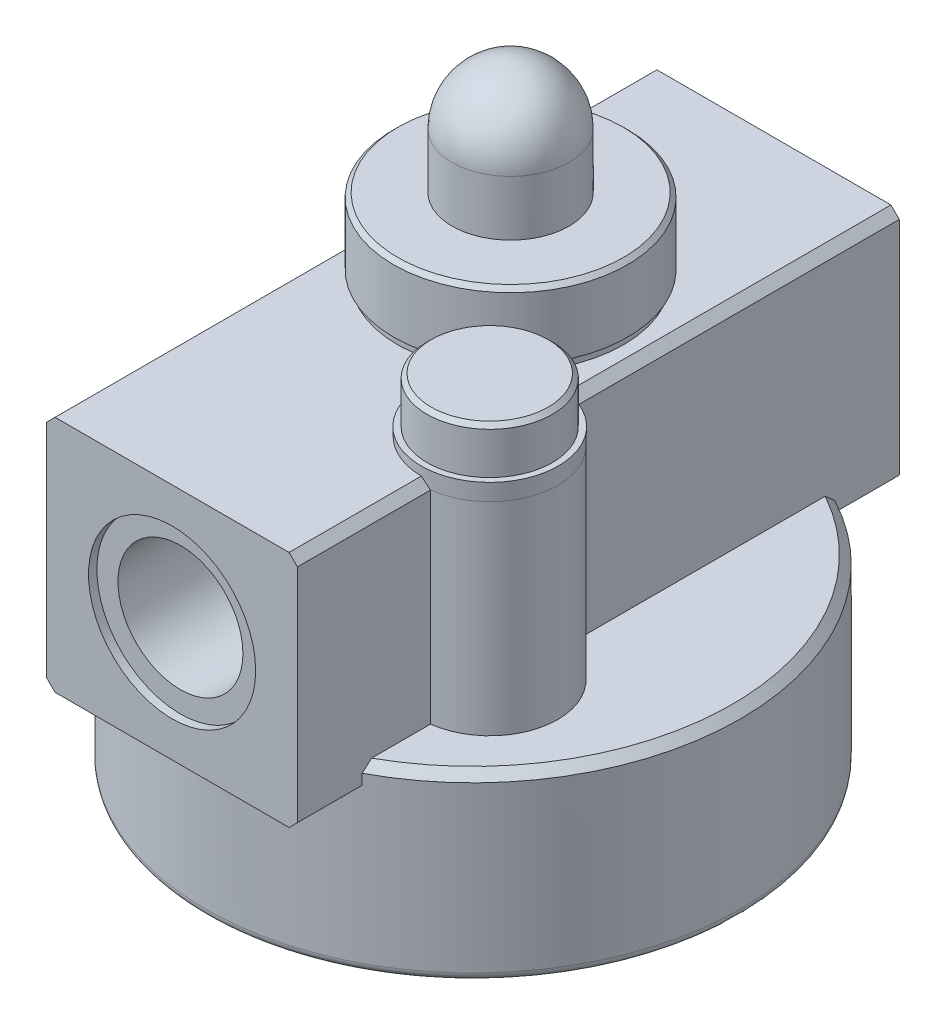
from build123d import *

# Parameters (mm, degrees)
EXTRUDE_1_DEPTH      = 36
EXTRUDE_1_DEPTH_BACK = 36


with BuildPart() as part:
    # Sketch 1 → Revolve 1 (revolve)
    with BuildSketch(Plane.XY, mode=Mode.PRIVATE) as revolve_1_sk:
        with BuildLine():
            Line((0, 16.7), (-30, 16.7))
            Line((-30, 16.7), (-30, 0))
            Line((-30, 0), (-31, 0))
            ThreePointArc((-31, 0), (-31.707106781, 0.292893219), (-32, 1))
            Line((-32, 1), (-32, 20.7))
            Line((-32, 20.7), (-31, 21.7))
            Line((-31, 21.7), (0, 21.7))
            Line((0, 21.7), (0, 16.7))
        make_face()
    revolve(revolve_1_sk.sketch.rotate(Axis((0, 21.7, 0), (0, -1, 0)), 90), axis=Axis((0, 21.7, 0), (0, -1, 0)))

    # Sketch 2 → Extrude 1 (add, two sides: drawn at the far end of the back side and taken through both)
    with BuildSketch(Plane.XY.offset(-EXTRUDE_1_DEPTH_BACK)):
        Polygon((-15, 45.95), (-15, 19.45), (-14, 18.45), (14, 18.45), (15, 19.45), (15, 45.95), (14, 46.95), (-14, 46.95), align=None)
    extrude(amount=EXTRUDE_1_DEPTH + EXTRUDE_1_DEPTH_BACK)

    # Sketch 3 → Revolve 2 (revolve)
    with BuildSketch(Plane(origin=(14, 0, 0), x_dir=(0, 0, -1), z_dir=(1, 0, 0)), mode=Mode.PRIVATE) as revolve_2_sk:
        Polygon((-12, 18), (-20.14, 18), (-20.14, 45.95), (-20.2, 48), (-19.5, 48), (-19.5, 53), (-19, 53.5), (-12, 53.5), align=None)
    revolve(revolve_2_sk.sketch.rotate(Axis((14, 53.5, 12), (0, -1, 0)), 180), axis=Axis((14, 53.5, 12), (0, -1, 0)))

    # Sketch 4 → Revolve 3 (revolve)
    with BuildSketch(Plane(origin=(-1, 0, 0), x_dir=(0, 0, -1), z_dir=(1, 0, 0)), mode=Mode.PRIVATE) as revolve_3_sk:
        with BuildLine():
            Line((5.5, 0), (-8, 0))
            Line((-8, 0), (-8, 48))
            Line((-8, 48), (-8.5, 48))
            Line((-8.5, 48), (-8.5, 55.5))
            Line((-8.5, 55.5), (-8, 56))
            Line((-8, 56), (-1.5, 56))
            Line((-1.5, 56), (-1.5, 62.6))
            ThreePointArc((-1.5, 62.6), (0.550252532, 67.549747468), (5.5, 69.6))
            Line((5.5, 69.6), (5.5, 0))
        make_face()
    revolve(revolve_3_sk.sketch.rotate(Axis((-1, 69.6, -5.5), (0, -1, 0)), 180), axis=Axis((-1, 69.6, -5.5), (0, -1, 0)))

    # Sketch 5 → Cut-Revolve 1 (revolve, cut)
    with BuildSketch(Plane(origin=(0, 0, 0), x_dir=(0, 0, -1), z_dir=(1, 0, 0)), mode=Mode.PRIVATE) as cut_revolve_1_sk:
        Polygon((-36, 32.7), (-36, 42.6972), (-35, 42.6972), (-35, 40.175), (-21, 40.175), (-21, 32.7), align=None)
    revolve(cut_revolve_1_sk.sketch.rotate(Axis((0, 32.7, 21), (0, 0, 1)), 270), axis=Axis((0, 32.7, 21), (0, 0, 1)), mode=Mode.SUBTRACT)

    # Sketch 6 → Cut-Revolve 2 (revolve, cut)
    with BuildSketch(Plane(origin=(0, 0, 0), x_dir=(0, 0, -1), z_dir=(1, 0, 0)), mode=Mode.PRIVATE) as cut_revolve_2_sk:
        Polygon((21, 32.7), (21, 40.175), (35, 40.175), (35, 42.6972), (36, 42.6972), (36, 32.7), align=None)
    revolve(cut_revolve_2_sk.sketch.rotate(Axis((0, 32.7, -36), (0, 0, 1)), 270), axis=Axis((0, 32.7, -36), (0, 0, 1)), mode=Mode.SUBTRACT)


solid = part.part
